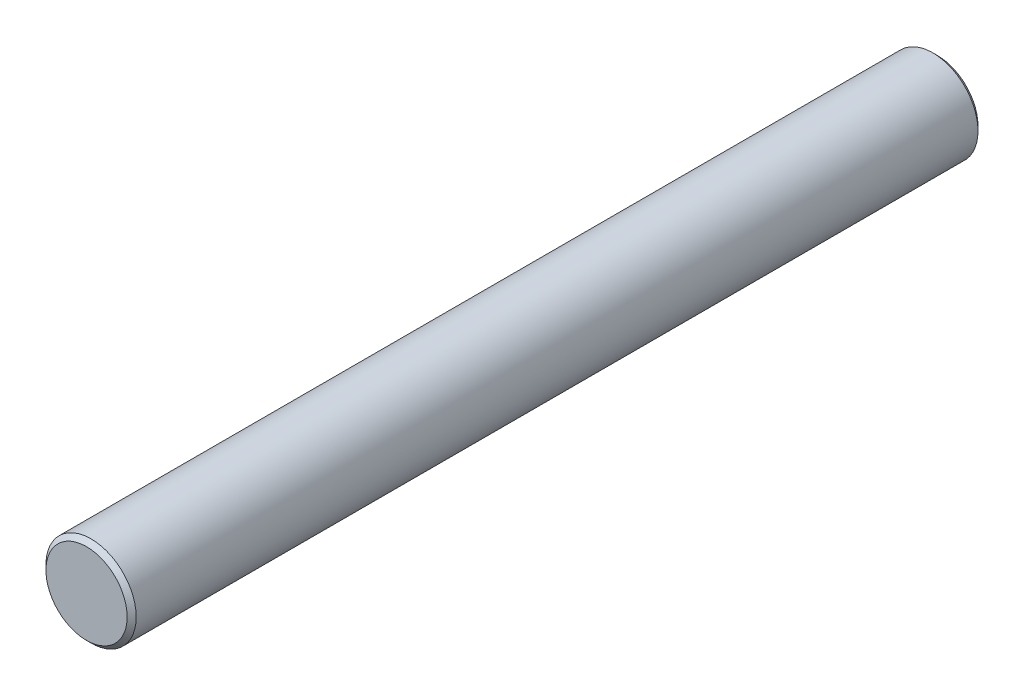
ISO-10303-21;
HEADER;
FILE_DESCRIPTION(('STEP AP214'),'2;1');
FILE_NAME('part.step','',(''),(''),'','','');
FILE_SCHEMA(('AUTOMOTIVE_DESIGN { 1 0 10303 214 1 1 1 1 }'));
ENDSEC;
DATA;
#1=APPLICATION_CONTEXT('core data for automotive mechanical design processes');
#2=APPLICATION_PROTOCOL_DEFINITION('international standard','automotive_design',2000,#1);
#3=PRODUCT_CONTEXT('',#1,'mechanical');
#4=PRODUCT('Part','Part','',(#3));
#5=PRODUCT_RELATED_PRODUCT_CATEGORY('part','',(#4));
#6=PRODUCT_DEFINITION_FORMATION('','',#4);
#7=PRODUCT_DEFINITION_CONTEXT('part definition',#1,'design');
#8=PRODUCT_DEFINITION('design','',#6,#7);
#9=PRODUCT_DEFINITION_SHAPE('','',#8);
#10=(LENGTH_UNIT() NAMED_UNIT(*) SI_UNIT(.MILLI.,.METRE.));
#11=(NAMED_UNIT(*) PLANE_ANGLE_UNIT() SI_UNIT($,.RADIAN.));
#12=(NAMED_UNIT(*) SI_UNIT($,.STERADIAN.) SOLID_ANGLE_UNIT());
#13=UNCERTAINTY_MEASURE_WITH_UNIT(LENGTH_MEASURE(1.E-05),#10,'distance_accuracy_value','');
#14=(GEOMETRIC_REPRESENTATION_CONTEXT(3) GLOBAL_UNCERTAINTY_ASSIGNED_CONTEXT((#13)) GLOBAL_UNIT_ASSIGNED_CONTEXT((#10,
#11,#12)) REPRESENTATION_CONTEXT('',''));
#15=CARTESIAN_POINT('',(0.,0.,0.));
#16=DIRECTION('',(0.,0.,1.));
#17=DIRECTION('',(1.,0.,0.));
#18=AXIS2_PLACEMENT_3D('',#15,#16,#17);
#19=CARTESIAN_POINT('',(0.,0.,-138.5));
#20=DIRECTION('',(0.,0.,1.));
#21=DIRECTION('',(1.,0.,0.));
#22=AXIS2_PLACEMENT_3D('',#19,#20,#21);
#23=CYLINDRICAL_SURFACE('',#22,6.99999999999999);
#24=CARTESIAN_POINT('',(0.,0.,-88.4999999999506));
#25=DIRECTION('',(0.,0.,1.));
#26=DIRECTION('',(1.,0.,0.));
#27=AXIS2_PLACEMENT_3D('',#24,#25,#26);
#28=CIRCLE('',#27,6.99999999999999);
#29=CARTESIAN_POINT('',(6.99999999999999,0.,-88.4999999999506));
#30=VERTEX_POINT('',#29);
#31=EDGE_CURVE('E11',#30,#30,#28,.T.);
#32=ORIENTED_EDGE('',*,*,#31,.T.);
#33=EDGE_LOOP('',(#32));
#34=FACE_BOUND('',#33,.T.);
#35=CARTESIAN_POINT('',(0.,0.,-138.293975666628));
#36=DIRECTION('',(0.,0.,1.));
#37=DIRECTION('',(1.,0.,0.));
#38=AXIS2_PLACEMENT_3D('',#35,#36,#37);
#39=CIRCLE('',#38,6.99999999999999);
#40=CARTESIAN_POINT('',(6.99999999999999,0.,-138.293975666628));
#41=VERTEX_POINT('',#40);
#42=EDGE_CURVE('E52',#41,#41,#39,.T.);
#43=ORIENTED_EDGE('',*,*,#42,.F.);
#44=EDGE_LOOP('',(#43));
#45=FACE_BOUND('',#44,.T.);
#46=ADVANCED_FACE('F33',(#34,#45),#23,.F.);
#47=CARTESIAN_POINT('',(0.,0.,-88.4999999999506));
#48=DIRECTION('',(0.,0.,-1.));
#49=DIRECTION('',(-1.,0.,0.));
#50=AXIS2_PLACEMENT_3D('',#47,#48,#49);
#51=CONICAL_SURFACE('',#50,6.99999999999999,1.02974425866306);
#52=CARTESIAN_POINT('',(0.,0.,-84.2939756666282));
#53=VERTEX_POINT('',#52);
#54=VERTEX_LOOP('',#53);
#55=FACE_BOUND('',#54,.T.);
#56=ORIENTED_EDGE('',*,*,#31,.F.);
#57=EDGE_LOOP('',(#56));
#58=FACE_BOUND('',#57,.T.);
#59=ADVANCED_FACE('F42',(#55,#58),#51,.F.);
#60=CARTESIAN_POINT('',(0.,0.,238.706024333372));
#61=DIRECTION('',(0.,0.,1.));
#62=DIRECTION('',(1.,0.,0.));
#63=AXIS2_PLACEMENT_3D('',#60,#61,#62);
#64=PLANE('',#63);
#65=CARTESIAN_POINT('',(0.,0.,238.706024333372));
#66=DIRECTION('',(0.,0.,1.));
#67=DIRECTION('',(1.,0.,0.));
#68=AXIS2_PLACEMENT_3D('',#65,#66,#67);
#69=CIRCLE('',#68,18.0000000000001);
#70=CARTESIAN_POINT('',(18.0000000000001,0.,238.706024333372));
#71=VERTEX_POINT('',#70);
#72=EDGE_CURVE('E39',#71,#71,#69,.T.);
#73=ORIENTED_EDGE('',*,*,#72,.T.);
#74=EDGE_LOOP('',(#73));
#75=FACE_BOUND('',#74,.T.);
#76=ADVANCED_FACE('F45',(#75),#64,.T.);
#77=CARTESIAN_POINT('',(0.,0.,238.706024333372));
#78=DIRECTION('',(0.,0.,-1.));
#79=DIRECTION('',(-1.,0.,0.));
#80=AXIS2_PLACEMENT_3D('',#77,#78,#79);
#81=CONICAL_SURFACE('',#80,18.0000000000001,0.785398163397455);
#82=CARTESIAN_POINT('',(0.,0.,236.706024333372));
#83=DIRECTION('',(0.,0.,1.));
#84=DIRECTION('',(1.,0.,0.));
#85=AXIS2_PLACEMENT_3D('',#82,#83,#84);
#86=CIRCLE('',#85,20.);
#87=CARTESIAN_POINT('',(20.,0.,236.706024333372));
#88=VERTEX_POINT('',#87);
#89=EDGE_CURVE('E62',#88,#88,#86,.T.);
#90=ORIENTED_EDGE('',*,*,#89,.T.);
#91=EDGE_LOOP('',(#90));
#92=FACE_BOUND('',#91,.T.);
#93=ORIENTED_EDGE('',*,*,#72,.F.);
#94=EDGE_LOOP('',(#93));
#95=FACE_BOUND('',#94,.T.);
#96=ADVANCED_FACE('F68',(#92,#95),#81,.T.);
#97=CARTESIAN_POINT('',(0.,0.,-138.5));
#98=DIRECTION('',(0.,0.,1.));
#99=DIRECTION('',(1.,0.,0.));
#100=AXIS2_PLACEMENT_3D('',#97,#98,#99);
#101=CYLINDRICAL_SURFACE('',#100,20.);
#102=CARTESIAN_POINT('',(0.,0.,-136.293975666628));
#103=DIRECTION('',(0.,0.,1.));
#104=DIRECTION('',(1.,0.,0.));
#105=AXIS2_PLACEMENT_3D('',#102,#103,#104);
#106=CIRCLE('',#105,20.);
#107=CARTESIAN_POINT('',(20.,0.,-136.293975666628));
#108=VERTEX_POINT('',#107);
#109=EDGE_CURVE('E57',#108,#108,#106,.T.);
#110=ORIENTED_EDGE('',*,*,#109,.T.);
#111=EDGE_LOOP('',(#110));
#112=FACE_BOUND('',#111,.T.);
#113=ORIENTED_EDGE('',*,*,#89,.F.);
#114=EDGE_LOOP('',(#113));
#115=FACE_BOUND('',#114,.T.);
#116=ADVANCED_FACE('F70',(#112,#115),#101,.T.);
#117=CARTESIAN_POINT('',(0.,0.,-136.293975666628));
#118=DIRECTION('',(0.,0.,1.));
#119=DIRECTION('',(1.,0.,0.));
#120=AXIS2_PLACEMENT_3D('',#117,#118,#119);
#121=CONICAL_SURFACE('',#120,20.,0.785398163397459);
#122=CARTESIAN_POINT('',(0.,0.,-138.293975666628));
#123=DIRECTION('',(0.,0.,1.));
#124=DIRECTION('',(1.,0.,0.));
#125=AXIS2_PLACEMENT_3D('',#122,#123,#124);
#126=CIRCLE('',#125,18.);
#127=CARTESIAN_POINT('',(18.,0.,-138.293975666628));
#128=VERTEX_POINT('',#127);
#129=EDGE_CURVE('E54',#128,#128,#126,.T.);
#130=ORIENTED_EDGE('',*,*,#129,.T.);
#131=EDGE_LOOP('',(#130));
#132=FACE_BOUND('',#131,.T.);
#133=ORIENTED_EDGE('',*,*,#109,.F.);
#134=EDGE_LOOP('',(#133));
#135=FACE_BOUND('',#134,.T.);
#136=ADVANCED_FACE('F77',(#132,#135),#121,.T.);
#137=CARTESIAN_POINT('',(18.,0.,-138.293975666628));
#138=DIRECTION('',(0.,0.,-1.));
#139=DIRECTION('',(-1.,0.,0.));
#140=AXIS2_PLACEMENT_3D('',#137,#138,#139);
#141=PLANE('',#140);
#142=ORIENTED_EDGE('',*,*,#42,.T.);
#143=EDGE_LOOP('',(#142));
#144=FACE_BOUND('',#143,.T.);
#145=ORIENTED_EDGE('',*,*,#129,.F.);
#146=EDGE_LOOP('',(#145));
#147=FACE_BOUND('',#146,.T.);
#148=ADVANCED_FACE('F84',(#144,#147),#141,.T.);
#149=CLOSED_SHELL('',(#46,#59,#76,#96,#116,#136,#148));
#150=MANIFOLD_SOLID_BREP('B2',#149);
#151=ADVANCED_BREP_SHAPE_REPRESENTATION('',(#18,#150),#14);
#152=SHAPE_DEFINITION_REPRESENTATION(#9,#151);
ENDSEC;
END-ISO-10303-21;
